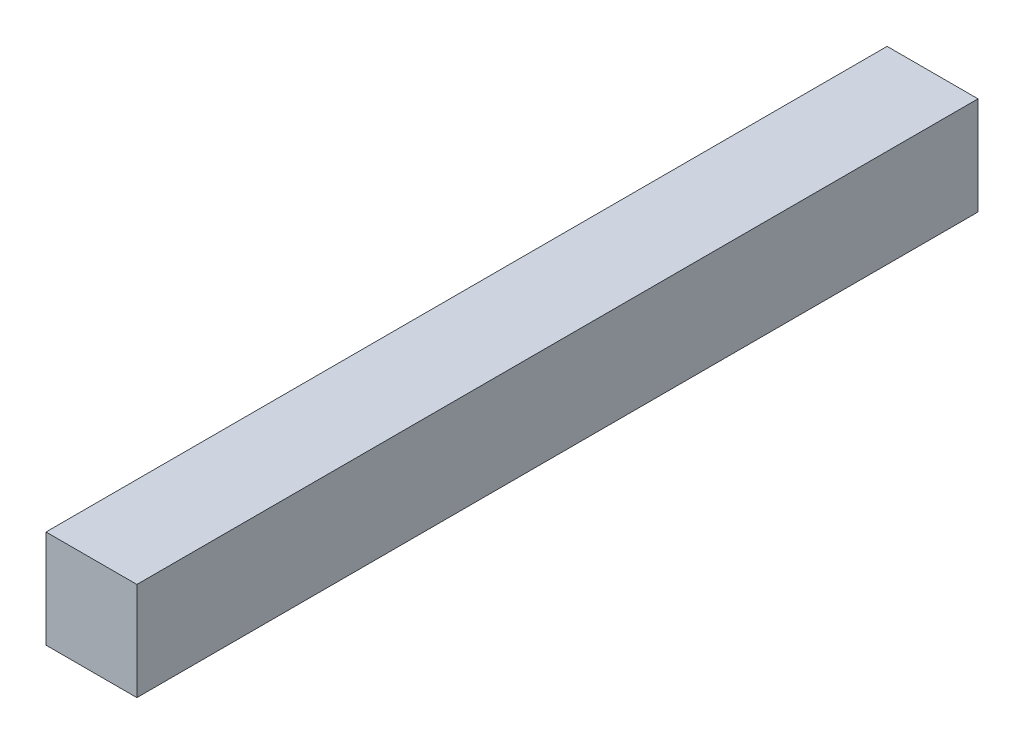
from build123d import *

# Parameters (mm, degrees)
SKETCH1_W           = 7.629549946
SKETCH1_H           = 8.231022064
BOSS_EXTRUDE1_DEPTH = 70.615530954


with BuildPart() as part:
    # Sketch1 → Boss-Extrude1 (new body)
    with BuildSketch(Plane.XY):
        Rectangle(SKETCH1_W, SKETCH1_H)
    extrude(amount=BOSS_EXTRUDE1_DEPTH)


solid = part.part
